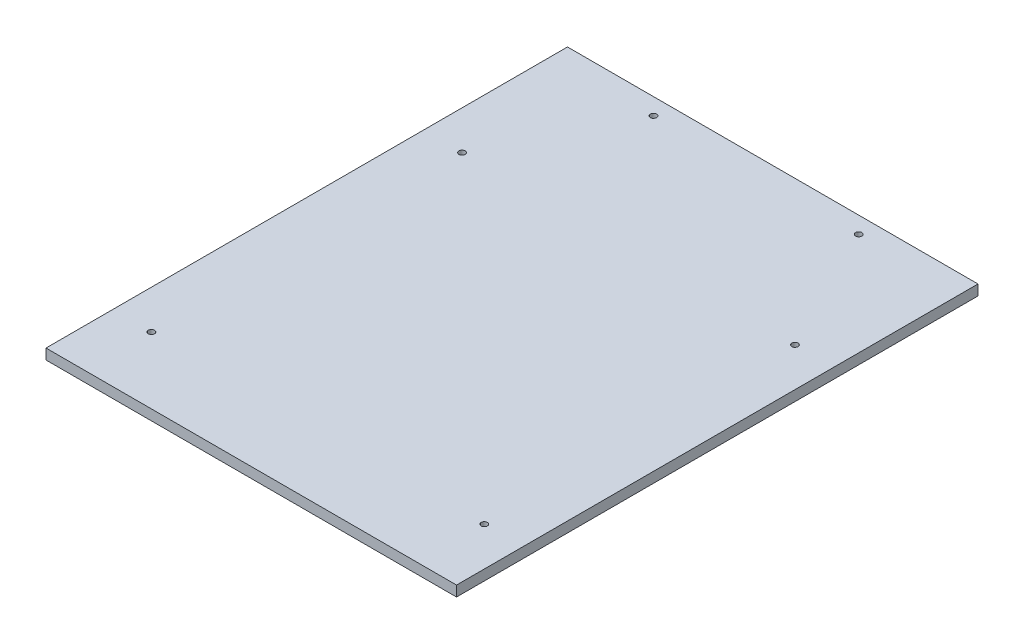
from build123d import *

# Parameters (mm, degrees)
SKETCH1_W                       = 469.9
SKETCH1_H                       = 596.9
BOSS_EXTRUDE1_DEPTH             = 11.90625
F_9_32_0_28125_DIAMETER_HOLE1_D = 7.14375


with BuildPart() as part:
    # Sketch1 → Boss-Extrude1 (new body)
    with BuildSketch(Plane(origin=(0, 0, 0), x_dir=(1, 0, 0), z_dir=(0, 1, 0))):
        Rectangle(SKETCH1_W, SKETCH1_H)
    extrude(amount=BOSS_EXTRUDE1_DEPTH)

    # 9_32 _0.28125_ Diameter Hole1 (through all)
    with Locations(Plane(origin=(0, 11.90625, 0), x_dir=(1, 0, 0), z_dir=(0, 1, 0))):
        with Locations((-190.5, 133.35), (190.5, 133.35), (190.5, -222.25), (-190.5, -222.25), (-117.475, 279.4), (117.475, 279.4)):
            Hole(F_9_32_0_28125_DIAMETER_HOLE1_D / 2)


solid = part.part
